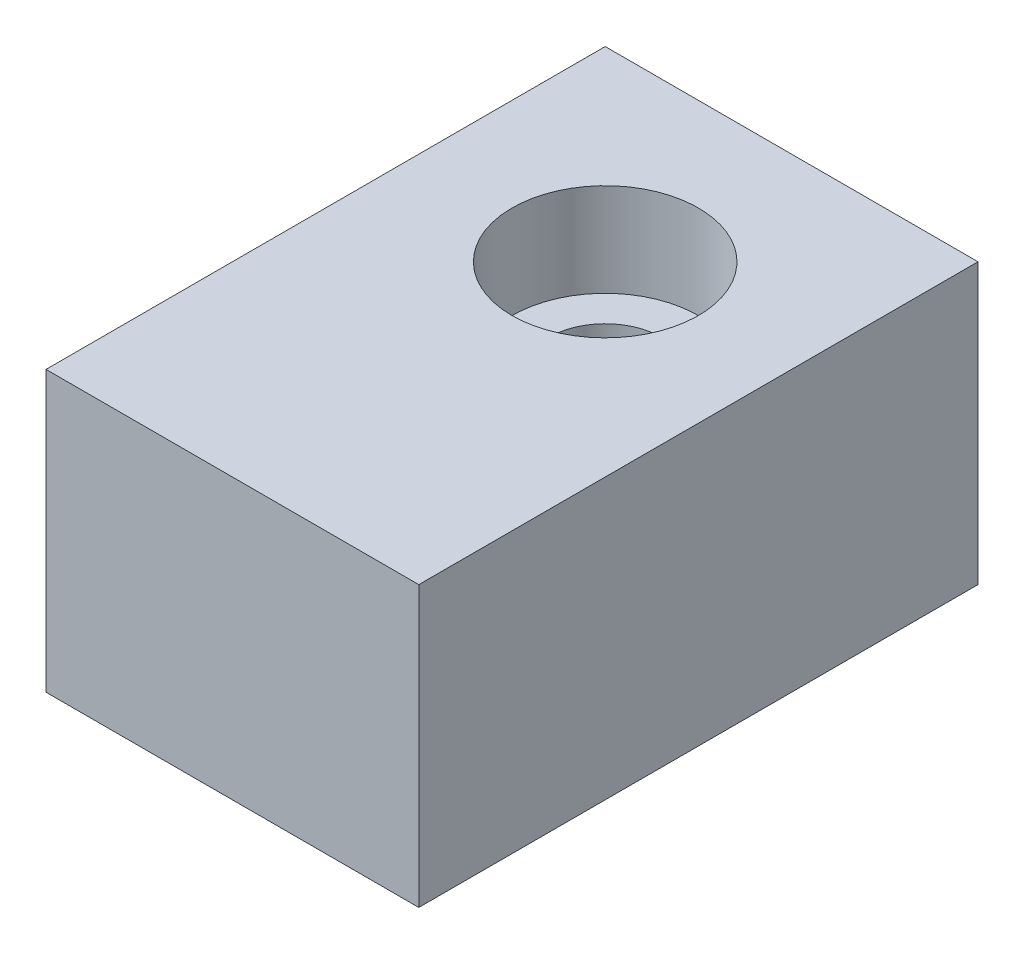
from build123d import *

# Parameters (mm, degrees)
SKETCH_1_W      = 30
SKETCH_1_H      = 15
EXTRUDE_1_DEPTH = 20


with BuildPart() as part:
    # Sketch 1 → Extrude 1 (new body)
    with BuildSketch(Plane(origin=(0, 0, 0), x_dir=(0, 0, -1), z_dir=(1, 0, 0))):
        Rectangle(SKETCH_1_W, SKETCH_1_H)
    extrude(amount=EXTRUDE_1_DEPTH)

    # Sketch 3 → Cut-Revolve 1 (revolve, cut)
    with BuildSketch(Plane(origin=(10, 0, 0), x_dir=(0, 0, -1), z_dir=(1, 0, 0))):
        Polygon((5, 7.523226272), (0, 7.5), (0, 2.5), (2, 2.5), (2, -7.5), (5, -7.5), align=None)
    revolve(axis=Axis((10, 10.15105742, -5), (0, -1, 0)), mode=Mode.SUBTRACT)


solid = part.part
